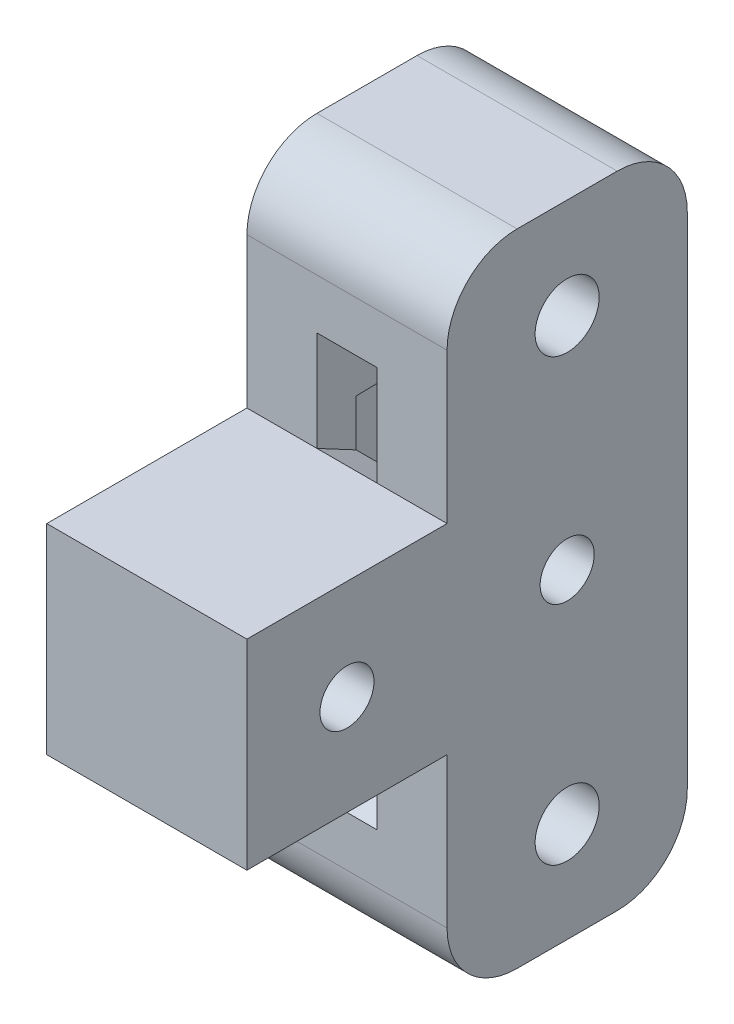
ISO-10303-21;
HEADER;
FILE_DESCRIPTION(('STEP AP214'),'2;1');
FILE_NAME('part.step','',(''),(''),'','','');
FILE_SCHEMA(('AUTOMOTIVE_DESIGN { 1 0 10303 214 1 1 1 1 }'));
ENDSEC;
DATA;
#1=APPLICATION_CONTEXT('core data for automotive mechanical design processes');
#2=APPLICATION_PROTOCOL_DEFINITION('international standard','automotive_design',2000,#1);
#3=PRODUCT_CONTEXT('',#1,'mechanical');
#4=PRODUCT('Part','Part','',(#3));
#5=PRODUCT_RELATED_PRODUCT_CATEGORY('part','',(#4));
#6=PRODUCT_DEFINITION_FORMATION('','',#4);
#7=PRODUCT_DEFINITION_CONTEXT('part definition',#1,'design');
#8=PRODUCT_DEFINITION('design','',#6,#7);
#9=PRODUCT_DEFINITION_SHAPE('','',#8);
#10=(LENGTH_UNIT() NAMED_UNIT(*) SI_UNIT(.MILLI.,.METRE.));
#11=(NAMED_UNIT(*) PLANE_ANGLE_UNIT() SI_UNIT($,.RADIAN.));
#12=(NAMED_UNIT(*) SI_UNIT($,.STERADIAN.) SOLID_ANGLE_UNIT());
#13=UNCERTAINTY_MEASURE_WITH_UNIT(LENGTH_MEASURE(1.E-05),#10,'distance_accuracy_value','');
#14=(GEOMETRIC_REPRESENTATION_CONTEXT(3) GLOBAL_UNCERTAINTY_ASSIGNED_CONTEXT((#13)) GLOBAL_UNIT_ASSIGNED_CONTEXT((#10,
#11,#12)) REPRESENTATION_CONTEXT('',''));
#15=CARTESIAN_POINT('',(0.,0.,0.));
#16=DIRECTION('',(0.,0.,1.));
#17=DIRECTION('',(1.,0.,0.));
#18=AXIS2_PLACEMENT_3D('',#15,#16,#17);
#19=CARTESIAN_POINT('',(10.,7.25364431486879,-12.));
#20=DIRECTION('',(-1.,0.,0.));
#21=DIRECTION('',(0.,0.,1.));
#22=AXIS2_PLACEMENT_3D('',#19,#20,#21);
#23=CYLINDRICAL_SURFACE('',#22,2.7);
#24=CARTESIAN_POINT('',(5.,7.25364431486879,-12.));
#25=DIRECTION('',(1.,0.,0.));
#26=DIRECTION('',(0.,1.,0.));
#27=AXIS2_PLACEMENT_3D('',#24,#25,#26);
#28=CIRCLE('',#27,2.7);
#29=CARTESIAN_POINT('',(5.,9.95364431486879,-12.));
#30=VERTEX_POINT('',#29);
#31=EDGE_CURVE('E331',#30,#30,#28,.T.);
#32=ORIENTED_EDGE('',*,*,#31,.F.);
#33=EDGE_LOOP('',(#32));
#34=FACE_BOUND('',#33,.T.);
#35=CARTESIAN_POINT('',(10.,7.25364431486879,-12.));
#36=DIRECTION('',(1.,0.,0.));
#37=DIRECTION('',(0.,0.,-1.));
#38=AXIS2_PLACEMENT_3D('',#35,#36,#37);
#39=CIRCLE('',#38,2.7);
#40=CARTESIAN_POINT('',(10.,7.25364431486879,-14.7));
#41=VERTEX_POINT('',#40);
#42=EDGE_CURVE('E417',#41,#41,#39,.T.);
#43=ORIENTED_EDGE('',*,*,#42,.T.);
#44=EDGE_LOOP('',(#43));
#45=FACE_BOUND('',#44,.T.);
#46=ADVANCED_FACE('F61',(#34,#45),#23,.F.);
#47=CARTESIAN_POINT('',(0.,-1.82878713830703,-1.29539088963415));
#48=DIRECTION('',(0.,-0.816024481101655,-0.578017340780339));
#49=DIRECTION('',(0.,0.578017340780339,-0.816024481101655));
#50=AXIS2_PLACEMENT_3D('',#47,#48,#49);
#51=PLANE('',#50);
#52=DIRECTION('',(-0.0169980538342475,0.577933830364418,-0.815906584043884));
#53=VECTOR('',#52,1.);
#54=CARTESIAN_POINT('',(-3.,-2.74635568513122,0.));
#55=LINE('',#54,#53);
#56=CARTESIAN_POINT('',(-3.,-2.74635568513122,0.));
#57=VERTEX_POINT('',#56);
#58=CARTESIAN_POINT('',(-3.08333333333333,0.0869776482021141,-4.));
#59=VERTEX_POINT('',#58);
#60=EDGE_CURVE('E463',#57,#59,#55,.T.);
#61=ORIENTED_EDGE('',*,*,#60,.T.);
#62=DIRECTION('',(1.,0.,0.));
#63=VECTOR('',#62,1.);
#64=CARTESIAN_POINT('',(0.,0.0869776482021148,-4.));
#65=LINE('',#64,#63);
#66=CARTESIAN_POINT('',(3.08333333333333,0.0869776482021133,-4.));
#67=VERTEX_POINT('',#66);
#68=EDGE_CURVE('E312',#59,#67,#65,.T.);
#69=ORIENTED_EDGE('',*,*,#68,.T.);
#70=DIRECTION('',(0.0169980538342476,0.577933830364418,-0.815906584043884));
#71=VECTOR('',#70,1.);
#72=CARTESIAN_POINT('',(3.,-2.74635568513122,0.));
#73=LINE('',#72,#71);
#74=CARTESIAN_POINT('',(3.,-2.74635568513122,0.));
#75=VERTEX_POINT('',#74);
#76=EDGE_CURVE('E653',#75,#67,#73,.T.);
#77=ORIENTED_EDGE('',*,*,#76,.F.);
#78=DIRECTION('',(-1.,0.,0.));
#79=VECTOR('',#78,1.);
#80=CARTESIAN_POINT('',(-3.,-2.74635568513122,0.));
#81=LINE('',#80,#79);
#82=EDGE_CURVE('E477',#75,#57,#81,.T.);
#83=ORIENTED_EDGE('',*,*,#82,.T.);
#84=EDGE_LOOP('',(#61,#69,#77,#83));
#85=FACE_BOUND('',#84,.T.);
#86=ADVANCED_FACE('F539',(#85),#51,.T.);
#87=CARTESIAN_POINT('',(-2.99869848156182,0.,0.062472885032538));
#88=DIRECTION('',(0.999783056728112,0.,-0.0208288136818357));
#89=DIRECTION('',(-0.0208288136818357,0.,-0.999783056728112));
#90=AXIS2_PLACEMENT_3D('',#87,#88,#89);
#91=PLANE('',#90);
#92=DIRECTION('',(-0.0208288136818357,0.,-0.999783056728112));
#93=VECTOR('',#92,1.);
#94=CARTESIAN_POINT('',(-2.99869848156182,-5.24635568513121,0.0624728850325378));
#95=LINE('',#94,#93);
#96=CARTESIAN_POINT('',(-3.08333333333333,-5.24635568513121,-4.));
#97=VERTEX_POINT('',#96);
#98=CARTESIAN_POINT('',(-3.22058823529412,-5.24635568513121,-10.5882352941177));
#99=VERTEX_POINT('',#98);
#100=EDGE_CURVE('E318',#97,#99,#95,.T.);
#101=ORIENTED_EDGE('',*,*,#100,.F.);
#102=DIRECTION('',(0.,1.,0.));
#103=VECTOR('',#102,1.);
#104=CARTESIAN_POINT('',(-3.08333333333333,0.,-4.));
#105=LINE('',#104,#103);
#106=EDGE_CURVE('E315',#97,#59,#105,.T.);
#107=ORIENTED_EDGE('',*,*,#106,.T.);
#108=ORIENTED_EDGE('',*,*,#60,.F.);
#109=DIRECTION('',(0.,-1.,0.));
#110=VECTOR('',#109,1.);
#111=CARTESIAN_POINT('',(-3.,-12.7463556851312,0.));
#112=LINE('',#111,#110);
#113=CARTESIAN_POINT('',(-3.,-12.7463556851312,0.));
#114=VERTEX_POINT('',#113);
#115=EDGE_CURVE('E467',#57,#114,#112,.T.);
#116=ORIENTED_EDGE('',*,*,#115,.T.);
#117=DIRECTION('',(-0.0169980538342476,0.577933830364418,-0.815906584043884));
#118=VECTOR('',#117,1.);
#119=CARTESIAN_POINT('',(-3.,-12.7463556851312,0.));
#120=LINE('',#119,#118);
#121=EDGE_CURVE('E494',#114,#99,#120,.T.);
#122=ORIENTED_EDGE('',*,*,#121,.T.);
#123=EDGE_LOOP('',(#101,#107,#108,#116,#122));
#124=FACE_BOUND('',#123,.T.);
#125=ADVANCED_FACE('F491',(#124),#91,.T.);
#126=CARTESIAN_POINT('',(2.99869848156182,0.,0.0624728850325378));
#127=DIRECTION('',(-0.999783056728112,0.,-0.0208288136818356));
#128=DIRECTION('',(-0.0208288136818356,0.,0.999783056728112));
#129=AXIS2_PLACEMENT_3D('',#126,#127,#128);
#130=PLANE('',#129);
#131=DIRECTION('',(0.0208288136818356,0.,-0.999783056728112));
#132=VECTOR('',#131,1.);
#133=CARTESIAN_POINT('',(2.99869848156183,19.7536443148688,0.0624728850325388));
#134=LINE('',#133,#132);
#135=CARTESIAN_POINT('',(3.08333333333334,19.7536443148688,-4.));
#136=VERTEX_POINT('',#135);
#137=CARTESIAN_POINT('',(3.28846153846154,19.7536443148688,-13.8461538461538));
#138=VERTEX_POINT('',#137);
#139=EDGE_CURVE('E292',#136,#138,#134,.T.);
#140=ORIENTED_EDGE('',*,*,#139,.F.);
#141=DIRECTION('',(0.,-1.,0.));
#142=VECTOR('',#141,1.);
#143=CARTESIAN_POINT('',(3.08333333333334,0.,-4.));
#144=LINE('',#143,#142);
#145=CARTESIAN_POINT('',(3.08333333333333,15.0869776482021,-3.99999999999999));
#146=VERTEX_POINT('',#145);
#147=EDGE_CURVE('E303',#136,#146,#144,.T.);
#148=ORIENTED_EDGE('',*,*,#147,.T.);
#149=DIRECTION('',(-0.0183155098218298,0.476203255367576,0.879144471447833));
#150=VECTOR('',#149,1.);
#151=CARTESIAN_POINT('',(3.5,4.25364431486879,-24.));
#152=LINE('',#151,#150);
#153=CARTESIAN_POINT('',(3.,17.2536443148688,0.));
#154=VERTEX_POINT('',#153);
#155=EDGE_CURVE('E327',#146,#154,#152,.T.);
#156=ORIENTED_EDGE('',*,*,#155,.T.);
#157=DIRECTION('',(0.,1.,0.));
#158=VECTOR('',#157,1.);
#159=CARTESIAN_POINT('',(3.,27.2536443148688,0.));
#160=LINE('',#159,#158);
#161=CARTESIAN_POINT('',(3.,27.2536443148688,0.));
#162=VERTEX_POINT('',#161);
#163=EDGE_CURVE('E744',#154,#162,#160,.T.);
#164=ORIENTED_EDGE('',*,*,#163,.T.);
#165=DIRECTION('',(-0.0183155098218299,0.476203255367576,0.879144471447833));
#166=VECTOR('',#165,1.);
#167=CARTESIAN_POINT('',(3.5,14.2536443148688,-24.));
#168=LINE('',#167,#166);
#169=EDGE_CURVE('E749',#138,#162,#168,.T.);
#170=ORIENTED_EDGE('',*,*,#169,.F.);
#171=EDGE_LOOP('',(#140,#148,#156,#164,#170));
#172=FACE_BOUND('',#171,.T.);
#173=ADVANCED_FACE('F677',(#172),#130,.T.);
#174=CARTESIAN_POINT('',(0.,13.3397303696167,-7.22568728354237));
#175=DIRECTION('',(0.,0.879291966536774,-0.476283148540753));
#176=DIRECTION('',(0.,0.476283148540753,0.879291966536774));
#177=AXIS2_PLACEMENT_3D('',#174,#175,#176);
#178=PLANE('',#177);
#179=ORIENTED_EDGE('',*,*,#155,.F.);
#180=DIRECTION('',(-1.,0.,0.));
#181=VECTOR('',#180,1.);
#182=CARTESIAN_POINT('',(0.,15.0869776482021,-4.));
#183=LINE('',#182,#181);
#184=CARTESIAN_POINT('',(-3.08333333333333,15.0869776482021,-3.99999999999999));
#185=VERTEX_POINT('',#184);
#186=EDGE_CURVE('E337',#146,#185,#183,.T.);
#187=ORIENTED_EDGE('',*,*,#186,.T.);
#188=DIRECTION('',(0.0183155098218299,0.476203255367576,0.879144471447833));
#189=VECTOR('',#188,1.);
#190=CARTESIAN_POINT('',(-3.5,4.25364431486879,-24.));
#191=LINE('',#190,#189);
#192=CARTESIAN_POINT('',(-3.,17.2536443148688,0.));
#193=VERTEX_POINT('',#192);
#194=EDGE_CURVE('E334',#185,#193,#191,.T.);
#195=ORIENTED_EDGE('',*,*,#194,.T.);
#196=DIRECTION('',(1.,0.,0.));
#197=VECTOR('',#196,1.);
#198=CARTESIAN_POINT('',(-3.,17.2536443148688,0.));
#199=LINE('',#198,#197);
#200=EDGE_CURVE('E627',#193,#154,#199,.T.);
#201=ORIENTED_EDGE('',*,*,#200,.T.);
#202=EDGE_LOOP('',(#179,#187,#195,#201));
#203=FACE_BOUND('',#202,.T.);
#204=ADVANCED_FACE('F772',(#203),#178,.T.);
#205=CARTESIAN_POINT('',(10.,39.2536443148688,0.));
#206=DIRECTION('',(0.,0.,-1.));
#207=DIRECTION('',(0.,1.,0.));
#208=AXIS2_PLACEMENT_3D('',#205,#206,#207);
#209=PLANE('',#208);
#210=DIRECTION('',(0.,-1.,0.));
#211=VECTOR('',#210,1.);
#212=CARTESIAN_POINT('',(10.,39.2536443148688,0.));
#213=LINE('',#212,#211);
#214=CARTESIAN_POINT('',(10.,32.2536443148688,0.));
#215=VERTEX_POINT('',#214);
#216=CARTESIAN_POINT('',(10.,17.2536443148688,0.));
#217=VERTEX_POINT('',#216);
#218=EDGE_CURVE('E595',#215,#217,#213,.T.);
#219=ORIENTED_EDGE('',*,*,#218,.F.);
#220=DIRECTION('',(-1.,0.,0.));
#221=VECTOR('',#220,1.);
#222=CARTESIAN_POINT('',(10.,32.2536443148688,0.));
#223=LINE('',#222,#221);
#224=CARTESIAN_POINT('',(-10.,32.2536443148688,0.));
#225=VERTEX_POINT('',#224);
#226=EDGE_CURVE('E386',#215,#225,#223,.T.);
#227=ORIENTED_EDGE('',*,*,#226,.T.);
#228=DIRECTION('',(0.,-1.,0.));
#229=VECTOR('',#228,1.);
#230=CARTESIAN_POINT('',(-10.,39.2536443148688,0.));
#231=LINE('',#230,#229);
#232=CARTESIAN_POINT('',(-10.,17.2536443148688,0.));
#233=VERTEX_POINT('',#232);
#234=EDGE_CURVE('E421',#225,#233,#231,.T.);
#235=ORIENTED_EDGE('',*,*,#234,.T.);
#236=DIRECTION('',(-1.,0.,0.));
#237=VECTOR('',#236,1.);
#238=CARTESIAN_POINT('',(10.,17.2536443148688,0.));
#239=LINE('',#238,#237);
#240=EDGE_CURVE('E453',#193,#233,#239,.T.);
#241=ORIENTED_EDGE('',*,*,#240,.F.);
#242=DIRECTION('',(0.,-1.,0.));
#243=VECTOR('',#242,1.);
#244=CARTESIAN_POINT('',(-3.,27.2536443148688,0.));
#245=LINE('',#244,#243);
#246=CARTESIAN_POINT('',(-3.,27.2536443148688,0.));
#247=VERTEX_POINT('',#246);
#248=EDGE_CURVE('E634',#247,#193,#245,.T.);
#249=ORIENTED_EDGE('',*,*,#248,.F.);
#250=DIRECTION('',(-1.,0.,0.));
#251=VECTOR('',#250,1.);
#252=CARTESIAN_POINT('',(-3.,27.2536443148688,0.));
#253=LINE('',#252,#251);
#254=EDGE_CURVE('E758',#162,#247,#253,.T.);
#255=ORIENTED_EDGE('',*,*,#254,.F.);
#256=ORIENTED_EDGE('',*,*,#163,.F.);
#257=EDGE_CURVE('E460',#217,#154,#239,.T.);
#258=ORIENTED_EDGE('',*,*,#257,.F.);
#259=EDGE_LOOP('',(#219,#227,#235,#241,#249,#255,#256,#258));
#260=FACE_BOUND('',#259,.T.);
#261=ADVANCED_FACE('F525',(#260),#209,.F.);
#262=CARTESIAN_POINT('',(10.,-2.74635568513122,0.));
#263=DIRECTION('',(0.,0.,-1.));
#264=DIRECTION('',(0.,1.,0.));
#265=AXIS2_PLACEMENT_3D('',#262,#263,#264);
#266=PLANE('',#265);
#267=DIRECTION('',(0.,-1.,0.));
#268=VECTOR('',#267,1.);
#269=CARTESIAN_POINT('',(-10.,-2.74635568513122,0.));
#270=LINE('',#269,#268);
#271=CARTESIAN_POINT('',(-10.,-2.74635568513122,0.));
#272=VERTEX_POINT('',#271);
#273=CARTESIAN_POINT('',(-10.,-17.7463556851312,0.));
#274=VERTEX_POINT('',#273);
#275=EDGE_CURVE('E408',#272,#274,#270,.T.);
#276=ORIENTED_EDGE('',*,*,#275,.T.);
#277=DIRECTION('',(-1.,0.,0.));
#278=VECTOR('',#277,1.);
#279=CARTESIAN_POINT('',(10.,-17.7463556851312,0.));
#280=LINE('',#279,#278);
#281=CARTESIAN_POINT('',(10.,-17.7463556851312,0.));
#282=VERTEX_POINT('',#281);
#283=EDGE_CURVE('E12',#274,#282,#280,.F.);
#284=ORIENTED_EDGE('',*,*,#283,.T.);
#285=DIRECTION('',(0.,-1.,0.));
#286=VECTOR('',#285,1.);
#287=CARTESIAN_POINT('',(10.,-2.74635568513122,0.));
#288=LINE('',#287,#286);
#289=CARTESIAN_POINT('',(10.,-2.74635568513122,0.));
#290=VERTEX_POINT('',#289);
#291=EDGE_CURVE('E436',#290,#282,#288,.T.);
#292=ORIENTED_EDGE('',*,*,#291,.F.);
#293=DIRECTION('',(-1.,0.,0.));
#294=VECTOR('',#293,1.);
#295=CARTESIAN_POINT('',(10.,-2.74635568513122,0.));
#296=LINE('',#295,#294);
#297=EDGE_CURVE('E447',#290,#75,#296,.T.);
#298=ORIENTED_EDGE('',*,*,#297,.T.);
#299=DIRECTION('',(0.,1.,0.));
#300=VECTOR('',#299,1.);
#301=CARTESIAN_POINT('',(3.,-12.7463556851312,0.));
#302=LINE('',#301,#300);
#303=CARTESIAN_POINT('',(3.,-12.7463556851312,0.));
#304=VERTEX_POINT('',#303);
#305=EDGE_CURVE('E484',#304,#75,#302,.T.);
#306=ORIENTED_EDGE('',*,*,#305,.F.);
#307=DIRECTION('',(1.,0.,0.));
#308=VECTOR('',#307,1.);
#309=CARTESIAN_POINT('',(-3.,-12.7463556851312,0.));
#310=LINE('',#309,#308);
#311=EDGE_CURVE('E462',#114,#304,#310,.T.);
#312=ORIENTED_EDGE('',*,*,#311,.F.);
#313=ORIENTED_EDGE('',*,*,#115,.F.);
#314=EDGE_CURVE('E442',#57,#272,#296,.T.);
#315=ORIENTED_EDGE('',*,*,#314,.T.);
#316=EDGE_LOOP('',(#276,#284,#292,#298,#306,#312,#313,#315));
#317=FACE_BOUND('',#316,.T.);
#318=ADVANCED_FACE('F499',(#317),#266,.F.);
#319=CARTESIAN_POINT('',(10.,-24.7463556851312,-24.));
#320=DIRECTION('',(0.,0.,1.));
#321=DIRECTION('',(0.,-1.,0.));
#322=AXIS2_PLACEMENT_3D('',#319,#320,#321);
#323=PLANE('',#322);
#324=DIRECTION('',(-1.,0.,0.));
#325=VECTOR('',#324,1.);
#326=CARTESIAN_POINT('',(-5.,-5.24635568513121,-24.));
#327=LINE('',#326,#325);
#328=CARTESIAN_POINT('',(5.,-5.24635568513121,-24.));
#329=VERTEX_POINT('',#328);
#330=CARTESIAN_POINT('',(-5.,-5.24635568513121,-24.));
#331=VERTEX_POINT('',#330);
#332=EDGE_CURVE('E283',#329,#331,#327,.T.);
#333=ORIENTED_EDGE('',*,*,#332,.F.);
#334=DIRECTION('',(0.,-1.,0.));
#335=VECTOR('',#334,1.);
#336=CARTESIAN_POINT('',(5.,-5.24635568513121,-24.));
#337=LINE('',#336,#335);
#338=CARTESIAN_POINT('',(5.,19.7536443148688,-24.));
#339=VERTEX_POINT('',#338);
#340=EDGE_CURVE('E243',#339,#329,#337,.T.);
#341=ORIENTED_EDGE('',*,*,#340,.F.);
#342=DIRECTION('',(1.,0.,0.));
#343=VECTOR('',#342,1.);
#344=CARTESIAN_POINT('',(-5.,19.7536443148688,-24.));
#345=LINE('',#344,#343);
#346=CARTESIAN_POINT('',(-5.,19.7536443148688,-24.));
#347=VERTEX_POINT('',#346);
#348=EDGE_CURVE('E270',#347,#339,#345,.T.);
#349=ORIENTED_EDGE('',*,*,#348,.F.);
#350=DIRECTION('',(0.,1.,0.));
#351=VECTOR('',#350,1.);
#352=CARTESIAN_POINT('',(-5.,-5.24635568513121,-24.));
#353=LINE('',#352,#351);
#354=EDGE_CURVE('E275',#331,#347,#353,.T.);
#355=ORIENTED_EDGE('',*,*,#354,.F.);
#356=EDGE_LOOP('',(#333,#341,#349,#355));
#357=FACE_BOUND('',#356,.T.);
#358=DIRECTION('',(0.,1.,0.));
#359=VECTOR('',#358,1.);
#360=CARTESIAN_POINT('',(-10.,-24.7463556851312,-24.));
#361=LINE('',#360,#359);
#362=CARTESIAN_POINT('',(-10.,-17.7463556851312,-24.));
#363=VERTEX_POINT('',#362);
#364=CARTESIAN_POINT('',(-10.,32.2536443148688,-24.));
#365=VERTEX_POINT('',#364);
#366=EDGE_CURVE('E409',#363,#365,#361,.T.);
#367=ORIENTED_EDGE('',*,*,#366,.T.);
#368=DIRECTION('',(-1.,0.,0.));
#369=VECTOR('',#368,1.);
#370=CARTESIAN_POINT('',(10.,32.2536443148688,-24.));
#371=LINE('',#370,#369);
#372=CARTESIAN_POINT('',(10.,32.2536443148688,-24.));
#373=VERTEX_POINT('',#372);
#374=EDGE_CURVE('E375',#365,#373,#371,.F.);
#375=ORIENTED_EDGE('',*,*,#374,.T.);
#376=DIRECTION('',(0.,1.,0.));
#377=VECTOR('',#376,1.);
#378=CARTESIAN_POINT('',(10.,-24.7463556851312,-24.));
#379=LINE('',#378,#377);
#380=CARTESIAN_POINT('',(10.,-17.7463556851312,-24.));
#381=VERTEX_POINT('',#380);
#382=EDGE_CURVE('E585',#381,#373,#379,.T.);
#383=ORIENTED_EDGE('',*,*,#382,.F.);
#384=DIRECTION('',(-1.,0.,0.));
#385=VECTOR('',#384,1.);
#386=CARTESIAN_POINT('',(10.,-17.7463556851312,-24.));
#387=LINE('',#386,#385);
#388=EDGE_CURVE('E368',#381,#363,#387,.T.);
#389=ORIENTED_EDGE('',*,*,#388,.T.);
#390=EDGE_LOOP('',(#367,#375,#383,#389));
#391=FACE_BOUND('',#390,.T.);
#392=ADVANCED_FACE('F521',(#357,#391),#323,.F.);
#393=CARTESIAN_POINT('',(-5.,7.25364431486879,-12.));
#394=DIRECTION('',(-1.,0.,0.));
#395=DIRECTION('',(0.,-1.,0.));
#396=AXIS2_PLACEMENT_3D('',#393,#394,#395);
#397=CIRCLE('',#396,2.7);
#398=CARTESIAN_POINT('',(-5.,4.55364431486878,-12.));
#399=VERTEX_POINT('',#398);
#400=EDGE_CURVE('E324',#399,#399,#397,.T.);
#401=ORIENTED_EDGE('',*,*,#400,.F.);
#402=EDGE_LOOP('',(#401));
#403=FACE_BOUND('',#402,.T.);
#404=CARTESIAN_POINT('',(-10.,7.25364431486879,-12.));
#405=DIRECTION('',(1.,0.,0.));
#406=DIRECTION('',(0.,0.,-1.));
#407=AXIS2_PLACEMENT_3D('',#404,#405,#406);
#408=CIRCLE('',#407,2.7);
#409=CARTESIAN_POINT('',(-10.,7.25364431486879,-14.7));
#410=VERTEX_POINT('',#409);
#411=EDGE_CURVE('E570',#410,#410,#408,.T.);
#412=ORIENTED_EDGE('',*,*,#411,.F.);
#413=EDGE_LOOP('',(#412));
#414=FACE_BOUND('',#413,.T.);
#415=ADVANCED_FACE('F541',(#403,#414),#23,.F.);
#416=CARTESIAN_POINT('',(10.,0.,0.));
#417=DIRECTION('',(1.,0.,0.));
#418=DIRECTION('',(0.,0.,-1.));
#419=AXIS2_PLACEMENT_3D('',#416,#417,#418);
#420=PLANE('',#419);
#421=CARTESIAN_POINT('',(10.,-14.7463556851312,-12.));
#422=DIRECTION('',(1.,0.,0.));
#423=DIRECTION('',(0.,0.,-1.));
#424=AXIS2_PLACEMENT_3D('',#421,#422,#423);
#425=CIRCLE('',#424,3.2);
#426=CARTESIAN_POINT('',(10.,-14.7463556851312,-15.2));
#427=VERTEX_POINT('',#426);
#428=EDGE_CURVE('E697',#427,#427,#425,.T.);
#429=ORIENTED_EDGE('',*,*,#428,.F.);
#430=EDGE_LOOP('',(#429));
#431=FACE_BOUND('',#430,.T.);
#432=ORIENTED_EDGE('',*,*,#42,.F.);
#433=EDGE_LOOP('',(#432));
#434=FACE_BOUND('',#433,.T.);
#435=ORIENTED_EDGE('',*,*,#382,.T.);
#436=CARTESIAN_POINT('',(10.,32.2536443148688,-17.));
#437=DIRECTION('',(1.,0.,0.));
#438=DIRECTION('',(0.,0.,-1.));
#439=AXIS2_PLACEMENT_3D('',#436,#437,#438);
#440=CIRCLE('',#439,7.);
#441=CARTESIAN_POINT('',(10.,39.2536443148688,-17.));
#442=VERTEX_POINT('',#441);
#443=EDGE_CURVE('E384',#373,#442,#440,.T.);
#444=ORIENTED_EDGE('',*,*,#443,.T.);
#445=DIRECTION('',(0.,0.,1.));
#446=VECTOR('',#445,1.);
#447=CARTESIAN_POINT('',(10.,39.2536443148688,-24.));
#448=LINE('',#447,#446);
#449=CARTESIAN_POINT('',(10.,39.2536443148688,-7.));
#450=VERTEX_POINT('',#449);
#451=EDGE_CURVE('E587',#442,#450,#448,.T.);
#452=ORIENTED_EDGE('',*,*,#451,.T.);
#453=CARTESIAN_POINT('',(10.,32.2536443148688,-7.));
#454=DIRECTION('',(1.,0.,0.));
#455=DIRECTION('',(0.,0.,-1.));
#456=AXIS2_PLACEMENT_3D('',#453,#454,#455);
#457=CIRCLE('',#456,7.);
#458=EDGE_CURVE('E80',#450,#215,#457,.T.);
#459=ORIENTED_EDGE('',*,*,#458,.T.);
#460=ORIENTED_EDGE('',*,*,#218,.T.);
#461=DIRECTION('',(0.,0.,1.));
#462=VECTOR('',#461,1.);
#463=CARTESIAN_POINT('',(10.,17.2536443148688,0.));
#464=LINE('',#463,#462);
#465=CARTESIAN_POINT('',(10.,17.2536443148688,20.));
#466=VERTEX_POINT('',#465);
#467=EDGE_CURVE('E593',#217,#466,#464,.T.);
#468=ORIENTED_EDGE('',*,*,#467,.T.);
#469=DIRECTION('',(0.,-1.,0.));
#470=VECTOR('',#469,1.);
#471=CARTESIAN_POINT('',(10.,17.2536443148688,20.));
#472=LINE('',#471,#470);
#473=CARTESIAN_POINT('',(10.,-2.74635568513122,20.));
#474=VERTEX_POINT('',#473);
#475=EDGE_CURVE('E596',#466,#474,#472,.T.);
#476=ORIENTED_EDGE('',*,*,#475,.T.);
#477=DIRECTION('',(0.,0.,-1.));
#478=VECTOR('',#477,1.);
#479=CARTESIAN_POINT('',(10.,-2.74635568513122,20.));
#480=LINE('',#479,#478);
#481=EDGE_CURVE('E598',#474,#290,#480,.T.);
#482=ORIENTED_EDGE('',*,*,#481,.T.);
#483=ORIENTED_EDGE('',*,*,#291,.T.);
#484=CARTESIAN_POINT('',(10.,-17.7463556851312,-7.));
#485=DIRECTION('',(1.,0.,0.));
#486=DIRECTION('',(0.,0.,-1.));
#487=AXIS2_PLACEMENT_3D('',#484,#485,#486);
#488=CIRCLE('',#487,7.);
#489=CARTESIAN_POINT('',(10.,-24.7463556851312,-7.));
#490=VERTEX_POINT('',#489);
#491=EDGE_CURVE('E377',#282,#490,#488,.T.);
#492=ORIENTED_EDGE('',*,*,#491,.T.);
#493=DIRECTION('',(0.,0.,-1.));
#494=VECTOR('',#493,1.);
#495=CARTESIAN_POINT('',(10.,-24.7463556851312,0.));
#496=LINE('',#495,#494);
#497=CARTESIAN_POINT('',(10.,-24.7463556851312,-17.));
#498=VERTEX_POINT('',#497);
#499=EDGE_CURVE('E400',#490,#498,#496,.T.);
#500=ORIENTED_EDGE('',*,*,#499,.T.);
#501=CARTESIAN_POINT('',(10.,-17.7463556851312,-17.));
#502=DIRECTION('',(1.,0.,0.));
#503=DIRECTION('',(0.,0.,-1.));
#504=AXIS2_PLACEMENT_3D('',#501,#502,#503);
#505=CIRCLE('',#504,7.);
#506=EDGE_CURVE('E374',#498,#381,#505,.T.);
#507=ORIENTED_EDGE('',*,*,#506,.T.);
#508=EDGE_LOOP('',(#435,#444,#452,#459,#460,#468,#476,#482,#483,#492,#500,#507));
#509=FACE_BOUND('',#508,.T.);
#510=CARTESIAN_POINT('',(10.,29.2536443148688,-12.));
#511=DIRECTION('',(1.,0.,0.));
#512=DIRECTION('',(0.,0.,-1.));
#513=AXIS2_PLACEMENT_3D('',#510,#511,#512);
#514=CIRCLE('',#513,3.20000000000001);
#515=CARTESIAN_POINT('',(10.,29.2536443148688,-15.2));
#516=VERTEX_POINT('',#515);
#517=EDGE_CURVE('E567',#516,#516,#514,.T.);
#518=ORIENTED_EDGE('',*,*,#517,.F.);
#519=EDGE_LOOP('',(#518));
#520=FACE_BOUND('',#519,.T.);
#521=CARTESIAN_POINT('',(10.,7.25364431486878,10.));
#522=DIRECTION('',(1.,0.,0.));
#523=DIRECTION('',(0.,0.,-1.));
#524=AXIS2_PLACEMENT_3D('',#521,#522,#523);
#525=CIRCLE('',#524,2.7);
#526=CARTESIAN_POINT('',(10.,7.25364431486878,7.3));
#527=VERTEX_POINT('',#526);
#528=EDGE_CURVE('E476',#527,#527,#525,.T.);
#529=ORIENTED_EDGE('',*,*,#528,.F.);
#530=EDGE_LOOP('',(#529));
#531=FACE_BOUND('',#530,.T.);
#532=ADVANCED_FACE('F551',(#431,#434,#509,#520,#531),#420,.T.);
#533=CARTESIAN_POINT('',(-10.,0.,0.));
#534=DIRECTION('',(1.,0.,0.));
#535=DIRECTION('',(0.,0.,-1.));
#536=AXIS2_PLACEMENT_3D('',#533,#534,#535);
#537=PLANE('',#536);
#538=DIRECTION('',(0.,0.,1.));
#539=VECTOR('',#538,1.);
#540=CARTESIAN_POINT('',(-10.,39.2536443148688,-24.));
#541=LINE('',#540,#539);
#542=CARTESIAN_POINT('',(-10.,39.2536443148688,-17.));
#543=VERTEX_POINT('',#542);
#544=CARTESIAN_POINT('',(-10.,39.2536443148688,-7.));
#545=VERTEX_POINT('',#544);
#546=EDGE_CURVE('E412',#543,#545,#541,.T.);
#547=ORIENTED_EDGE('',*,*,#546,.F.);
#548=CARTESIAN_POINT('',(-10.,32.2536443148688,-17.));
#549=DIRECTION('',(1.,0.,0.));
#550=DIRECTION('',(0.,0.,-1.));
#551=AXIS2_PLACEMENT_3D('',#548,#549,#550);
#552=CIRCLE('',#551,7.);
#553=EDGE_CURVE('E362',#543,#365,#552,.F.);
#554=ORIENTED_EDGE('',*,*,#553,.T.);
#555=ORIENTED_EDGE('',*,*,#366,.F.);
#556=CARTESIAN_POINT('',(-10.,-17.7463556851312,-17.));
#557=DIRECTION('',(1.,0.,0.));
#558=DIRECTION('',(0.,0.,-1.));
#559=AXIS2_PLACEMENT_3D('',#556,#557,#558);
#560=CIRCLE('',#559,7.);
#561=CARTESIAN_POINT('',(-10.,-24.7463556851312,-17.));
#562=VERTEX_POINT('',#561);
#563=EDGE_CURVE('E358',#363,#562,#560,.F.);
#564=ORIENTED_EDGE('',*,*,#563,.T.);
#565=DIRECTION('',(0.,0.,-1.));
#566=VECTOR('',#565,1.);
#567=CARTESIAN_POINT('',(-10.,-24.7463556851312,0.));
#568=LINE('',#567,#566);
#569=CARTESIAN_POINT('',(-10.,-24.7463556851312,-7.));
#570=VERTEX_POINT('',#569);
#571=EDGE_CURVE('E397',#570,#562,#568,.T.);
#572=ORIENTED_EDGE('',*,*,#571,.F.);
#573=CARTESIAN_POINT('',(-10.,-17.7463556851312,-7.));
#574=DIRECTION('',(1.,0.,0.));
#575=DIRECTION('',(0.,0.,-1.));
#576=AXIS2_PLACEMENT_3D('',#573,#574,#575);
#577=CIRCLE('',#576,7.);
#578=EDGE_CURVE('E360',#570,#274,#577,.F.);
#579=ORIENTED_EDGE('',*,*,#578,.T.);
#580=ORIENTED_EDGE('',*,*,#275,.F.);
#581=DIRECTION('',(0.,0.,-1.));
#582=VECTOR('',#581,1.);
#583=CARTESIAN_POINT('',(-10.,-2.74635568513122,20.));
#584=LINE('',#583,#582);
#585=CARTESIAN_POINT('',(-10.,-2.74635568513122,20.));
#586=VERTEX_POINT('',#585);
#587=EDGE_CURVE('E435',#586,#272,#584,.T.);
#588=ORIENTED_EDGE('',*,*,#587,.F.);
#589=DIRECTION('',(0.,-1.,0.));
#590=VECTOR('',#589,1.);
#591=CARTESIAN_POINT('',(-10.,17.2536443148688,20.));
#592=LINE('',#591,#590);
#593=CARTESIAN_POINT('',(-10.,17.2536443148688,20.));
#594=VERTEX_POINT('',#593);
#595=EDGE_CURVE('E429',#594,#586,#592,.T.);
#596=ORIENTED_EDGE('',*,*,#595,.F.);
#597=DIRECTION('',(0.,0.,1.));
#598=VECTOR('',#597,1.);
#599=CARTESIAN_POINT('',(-10.,17.2536443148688,0.));
#600=LINE('',#599,#598);
#601=EDGE_CURVE('E428',#233,#594,#600,.T.);
#602=ORIENTED_EDGE('',*,*,#601,.F.);
#603=ORIENTED_EDGE('',*,*,#234,.F.);
#604=CARTESIAN_POINT('',(-10.,32.2536443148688,-7.));
#605=DIRECTION('',(1.,0.,0.));
#606=DIRECTION('',(0.,0.,-1.));
#607=AXIS2_PLACEMENT_3D('',#604,#605,#606);
#608=CIRCLE('',#607,7.);
#609=EDGE_CURVE('E365',#225,#545,#608,.F.);
#610=ORIENTED_EDGE('',*,*,#609,.T.);
#611=EDGE_LOOP('',(#547,#554,#555,#564,#572,#579,#580,#588,#596,#602,#603,#610));
#612=FACE_BOUND('',#611,.T.);
#613=ORIENTED_EDGE('',*,*,#411,.T.);
#614=EDGE_LOOP('',(#613));
#615=FACE_BOUND('',#614,.T.);
#616=CARTESIAN_POINT('',(-10.,29.2536443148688,-12.));
#617=DIRECTION('',(1.,0.,0.));
#618=DIRECTION('',(0.,0.,-1.));
#619=AXIS2_PLACEMENT_3D('',#616,#617,#618);
#620=CIRCLE('',#619,3.20000000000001);
#621=CARTESIAN_POINT('',(-10.,29.2536443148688,-15.2));
#622=VERTEX_POINT('',#621);
#623=EDGE_CURVE('E577',#622,#622,#620,.T.);
#624=ORIENTED_EDGE('',*,*,#623,.T.);
#625=EDGE_LOOP('',(#624));
#626=FACE_BOUND('',#625,.T.);
#627=CARTESIAN_POINT('',(-10.,-14.7463556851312,-12.));
#628=DIRECTION('',(1.,0.,0.));
#629=DIRECTION('',(0.,0.,-1.));
#630=AXIS2_PLACEMENT_3D('',#627,#628,#629);
#631=CIRCLE('',#630,3.2);
#632=CARTESIAN_POINT('',(-10.,-14.7463556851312,-15.2));
#633=VERTEX_POINT('',#632);
#634=EDGE_CURVE('E705',#633,#633,#631,.T.);
#635=ORIENTED_EDGE('',*,*,#634,.T.);
#636=EDGE_LOOP('',(#635));
#637=FACE_BOUND('',#636,.T.);
#638=CARTESIAN_POINT('',(-10.,7.25364431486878,10.));
#639=DIRECTION('',(1.,0.,0.));
#640=DIRECTION('',(0.,0.,-1.));
#641=AXIS2_PLACEMENT_3D('',#638,#639,#640);
#642=CIRCLE('',#641,2.7);
#643=CARTESIAN_POINT('',(-10.,7.25364431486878,7.3));
#644=VERTEX_POINT('',#643);
#645=EDGE_CURVE('E710',#644,#644,#642,.T.);
#646=ORIENTED_EDGE('',*,*,#645,.T.);
#647=EDGE_LOOP('',(#646));
#648=FACE_BOUND('',#647,.T.);
#649=ADVANCED_FACE('F405',(#612,#615,#626,#637,#648),#537,.F.);
#650=CARTESIAN_POINT('',(10.,-24.7463556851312,0.));
#651=DIRECTION('',(0.,1.,0.));
#652=DIRECTION('',(0.,0.,1.));
#653=AXIS2_PLACEMENT_3D('',#650,#651,#652);
#654=PLANE('',#653);
#655=ORIENTED_EDGE('',*,*,#499,.F.);
#656=DIRECTION('',(-1.,0.,0.));
#657=VECTOR('',#656,1.);
#658=CARTESIAN_POINT('',(10.,-24.7463556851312,-7.));
#659=LINE('',#658,#657);
#660=EDGE_CURVE('E69',#490,#570,#659,.T.);
#661=ORIENTED_EDGE('',*,*,#660,.T.);
#662=ORIENTED_EDGE('',*,*,#571,.T.);
#663=DIRECTION('',(-1.,0.,0.));
#664=VECTOR('',#663,1.);
#665=CARTESIAN_POINT('',(10.,-24.7463556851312,-17.));
#666=LINE('',#665,#664);
#667=EDGE_CURVE('E85',#562,#498,#666,.F.);
#668=ORIENTED_EDGE('',*,*,#667,.T.);
#669=EDGE_LOOP('',(#655,#661,#662,#668));
#670=FACE_BOUND('',#669,.T.);
#671=ADVANCED_FACE('F394',(#670),#654,.F.);
#672=CARTESIAN_POINT('',(10.,39.2536443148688,-24.));
#673=DIRECTION('',(0.,-1.,0.));
#674=DIRECTION('',(0.,0.,-1.));
#675=AXIS2_PLACEMENT_3D('',#672,#673,#674);
#676=PLANE('',#675);
#677=ORIENTED_EDGE('',*,*,#451,.F.);
#678=DIRECTION('',(-1.,0.,0.));
#679=VECTOR('',#678,1.);
#680=CARTESIAN_POINT('',(10.,39.2536443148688,-17.));
#681=LINE('',#680,#679);
#682=EDGE_CURVE('E355',#442,#543,#681,.T.);
#683=ORIENTED_EDGE('',*,*,#682,.T.);
#684=ORIENTED_EDGE('',*,*,#546,.T.);
#685=DIRECTION('',(-1.,0.,0.));
#686=VECTOR('',#685,1.);
#687=CARTESIAN_POINT('',(10.,39.2536443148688,-7.));
#688=LINE('',#687,#686);
#689=EDGE_CURVE('E344',#545,#450,#688,.F.);
#690=ORIENTED_EDGE('',*,*,#689,.T.);
#691=EDGE_LOOP('',(#677,#683,#684,#690));
#692=FACE_BOUND('',#691,.T.);
#693=ADVANCED_FACE('F639',(#692),#676,.F.);
#694=CARTESIAN_POINT('',(10.,17.2536443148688,0.));
#695=DIRECTION('',(0.,-1.,0.));
#696=DIRECTION('',(0.,0.,-1.));
#697=AXIS2_PLACEMENT_3D('',#694,#695,#696);
#698=PLANE('',#697);
#699=ORIENTED_EDGE('',*,*,#601,.T.);
#700=DIRECTION('',(-1.,0.,0.));
#701=VECTOR('',#700,1.);
#702=CARTESIAN_POINT('',(10.,17.2536443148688,20.));
#703=LINE('',#702,#701);
#704=EDGE_CURVE('E451',#466,#594,#703,.T.);
#705=ORIENTED_EDGE('',*,*,#704,.F.);
#706=ORIENTED_EDGE('',*,*,#467,.F.);
#707=ORIENTED_EDGE('',*,*,#257,.T.);
#708=ORIENTED_EDGE('',*,*,#200,.F.);
#709=ORIENTED_EDGE('',*,*,#240,.T.);
#710=EDGE_LOOP('',(#699,#705,#706,#707,#708,#709));
#711=FACE_BOUND('',#710,.T.);
#712=ADVANCED_FACE('F630',(#711),#698,.F.);
#713=CARTESIAN_POINT('',(10.,17.2536443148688,20.));
#714=DIRECTION('',(0.,0.,-1.));
#715=DIRECTION('',(0.,1.,0.));
#716=AXIS2_PLACEMENT_3D('',#713,#714,#715);
#717=PLANE('',#716);
#718=ORIENTED_EDGE('',*,*,#595,.T.);
#719=DIRECTION('',(-1.,0.,0.));
#720=VECTOR('',#719,1.);
#721=CARTESIAN_POINT('',(10.,-2.74635568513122,20.));
#722=LINE('',#721,#720);
#723=EDGE_CURVE('E437',#474,#586,#722,.T.);
#724=ORIENTED_EDGE('',*,*,#723,.F.);
#725=ORIENTED_EDGE('',*,*,#475,.F.);
#726=ORIENTED_EDGE('',*,*,#704,.T.);
#727=EDGE_LOOP('',(#718,#724,#725,#726));
#728=FACE_BOUND('',#727,.T.);
#729=ADVANCED_FACE('F618',(#728),#717,.F.);
#730=CARTESIAN_POINT('',(10.,-2.74635568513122,20.));
#731=DIRECTION('',(0.,1.,0.));
#732=DIRECTION('',(0.,0.,1.));
#733=AXIS2_PLACEMENT_3D('',#730,#731,#732);
#734=PLANE('',#733);
#735=ORIENTED_EDGE('',*,*,#587,.T.);
#736=ORIENTED_EDGE('',*,*,#314,.F.);
#737=ORIENTED_EDGE('',*,*,#82,.F.);
#738=ORIENTED_EDGE('',*,*,#297,.F.);
#739=ORIENTED_EDGE('',*,*,#481,.F.);
#740=ORIENTED_EDGE('',*,*,#723,.T.);
#741=EDGE_LOOP('',(#735,#736,#737,#738,#739,#740));
#742=FACE_BOUND('',#741,.T.);
#743=ADVANCED_FACE('F607',(#742),#734,.F.);
#744=CARTESIAN_POINT('',(10.,29.2536443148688,-12.));
#745=DIRECTION('',(-1.,0.,0.));
#746=DIRECTION('',(0.,0.,1.));
#747=AXIS2_PLACEMENT_3D('',#744,#745,#746);
#748=CYLINDRICAL_SURFACE('',#747,3.20000000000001);
#749=ORIENTED_EDGE('',*,*,#517,.T.);
#750=EDGE_LOOP('',(#749));
#751=FACE_BOUND('',#750,.T.);
#752=ORIENTED_EDGE('',*,*,#623,.F.);
#753=EDGE_LOOP('',(#752));
#754=FACE_BOUND('',#753,.T.);
#755=ADVANCED_FACE('F685',(#751,#754),#748,.F.);
#756=CARTESIAN_POINT('',(10.,-14.7463556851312,-12.));
#757=DIRECTION('',(-1.,0.,0.));
#758=DIRECTION('',(0.,0.,1.));
#759=AXIS2_PLACEMENT_3D('',#756,#757,#758);
#760=CYLINDRICAL_SURFACE('',#759,3.2);
#761=ORIENTED_EDGE('',*,*,#428,.T.);
#762=EDGE_LOOP('',(#761));
#763=FACE_BOUND('',#762,.T.);
#764=ORIENTED_EDGE('',*,*,#634,.F.);
#765=EDGE_LOOP('',(#764));
#766=FACE_BOUND('',#765,.T.);
#767=ADVANCED_FACE('F683',(#763,#766),#760,.F.);
#768=CARTESIAN_POINT('',(10.,7.25364431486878,10.));
#769=DIRECTION('',(-1.,0.,0.));
#770=DIRECTION('',(0.,0.,1.));
#771=AXIS2_PLACEMENT_3D('',#768,#769,#770);
#772=CYLINDRICAL_SURFACE('',#771,2.7);
#773=ORIENTED_EDGE('',*,*,#528,.T.);
#774=EDGE_LOOP('',(#773));
#775=FACE_BOUND('',#774,.T.);
#776=ORIENTED_EDGE('',*,*,#645,.F.);
#777=EDGE_LOOP('',(#776));
#778=FACE_BOUND('',#777,.T.);
#779=ADVANCED_FACE('F680',(#775,#778),#772,.F.);
#780=DIRECTION('',(0.0208288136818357,0.,0.999783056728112));
#781=VECTOR('',#780,1.);
#782=CARTESIAN_POINT('',(-2.99869848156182,19.7536443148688,0.062472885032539));
#783=LINE('',#782,#781);
#784=CARTESIAN_POINT('',(-3.28846153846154,19.7536443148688,-13.8461538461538));
#785=VERTEX_POINT('',#784);
#786=CARTESIAN_POINT('',(-3.08333333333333,19.7536443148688,-4.));
#787=VERTEX_POINT('',#786);
#788=EDGE_CURVE('E297',#785,#787,#783,.T.);
#789=ORIENTED_EDGE('',*,*,#788,.F.);
#790=DIRECTION('',(0.0183155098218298,0.476203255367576,0.879144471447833));
#791=VECTOR('',#790,1.);
#792=CARTESIAN_POINT('',(-3.5,14.2536443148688,-24.));
#793=LINE('',#792,#791);
#794=EDGE_CURVE('E748',#785,#247,#793,.T.);
#795=ORIENTED_EDGE('',*,*,#794,.T.);
#796=ORIENTED_EDGE('',*,*,#248,.T.);
#797=ORIENTED_EDGE('',*,*,#194,.F.);
#798=EDGE_CURVE('E310',#185,#787,#105,.T.);
#799=ORIENTED_EDGE('',*,*,#798,.T.);
#800=EDGE_LOOP('',(#789,#795,#796,#797,#799));
#801=FACE_BOUND('',#800,.T.);
#802=ADVANCED_FACE('F678',(#801),#91,.T.);
#803=CARTESIAN_POINT('',(0.,-8.48774667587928,-6.01215389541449));
#804=DIRECTION('',(0.,0.816024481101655,0.578017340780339));
#805=DIRECTION('',(0.,-0.578017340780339,0.816024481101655));
#806=AXIS2_PLACEMENT_3D('',#803,#804,#805);
#807=PLANE('',#806);
#808=DIRECTION('',(1.,0.,0.));
#809=VECTOR('',#808,1.);
#810=CARTESIAN_POINT('',(0.,-5.24635568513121,-10.5882352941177));
#811=LINE('',#810,#809);
#812=CARTESIAN_POINT('',(3.22058823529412,-5.24635568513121,-10.5882352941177));
#813=VERTEX_POINT('',#812);
#814=EDGE_CURVE('E320',#99,#813,#811,.T.);
#815=ORIENTED_EDGE('',*,*,#814,.F.);
#816=ORIENTED_EDGE('',*,*,#121,.F.);
#817=ORIENTED_EDGE('',*,*,#311,.T.);
#818=DIRECTION('',(0.0169980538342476,0.577933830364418,-0.815906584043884));
#819=VECTOR('',#818,1.);
#820=CARTESIAN_POINT('',(3.,-12.7463556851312,0.));
#821=LINE('',#820,#819);
#822=EDGE_CURVE('E708',#304,#813,#821,.T.);
#823=ORIENTED_EDGE('',*,*,#822,.T.);
#824=EDGE_LOOP('',(#815,#816,#817,#823));
#825=FACE_BOUND('',#824,.T.);
#826=ADVANCED_FACE('F669',(#825),#807,.T.);
#827=DIRECTION('',(-0.0208288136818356,0.,0.999783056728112));
#828=VECTOR('',#827,1.);
#829=CARTESIAN_POINT('',(2.99869848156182,-5.24635568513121,0.0624728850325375));
#830=LINE('',#829,#828);
#831=CARTESIAN_POINT('',(3.08333333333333,-5.24635568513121,-4.));
#832=VERTEX_POINT('',#831);
#833=EDGE_CURVE('E253',#813,#832,#830,.T.);
#834=ORIENTED_EDGE('',*,*,#833,.F.);
#835=ORIENTED_EDGE('',*,*,#822,.F.);
#836=ORIENTED_EDGE('',*,*,#305,.T.);
#837=ORIENTED_EDGE('',*,*,#76,.T.);
#838=EDGE_CURVE('E308',#67,#832,#144,.T.);
#839=ORIENTED_EDGE('',*,*,#838,.T.);
#840=EDGE_LOOP('',(#834,#835,#836,#837,#839));
#841=FACE_BOUND('',#840,.T.);
#842=ADVANCED_FACE('F671',(#841),#130,.T.);
#843=CARTESIAN_POINT('',(0.,21.0712739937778,-11.4136067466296));
#844=DIRECTION('',(0.,-0.879291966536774,0.476283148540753));
#845=DIRECTION('',(0.,-0.476283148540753,-0.879291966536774));
#846=AXIS2_PLACEMENT_3D('',#843,#844,#845);
#847=PLANE('',#846);
#848=DIRECTION('',(-1.,0.,0.));
#849=VECTOR('',#848,1.);
#850=CARTESIAN_POINT('',(0.,19.7536443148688,-13.8461538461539));
#851=LINE('',#850,#849);
#852=EDGE_CURVE('E338',#138,#785,#851,.T.);
#853=ORIENTED_EDGE('',*,*,#852,.F.);
#854=ORIENTED_EDGE('',*,*,#169,.T.);
#855=ORIENTED_EDGE('',*,*,#254,.T.);
#856=ORIENTED_EDGE('',*,*,#794,.F.);
#857=EDGE_LOOP('',(#853,#854,#855,#856));
#858=FACE_BOUND('',#857,.T.);
#859=ADVANCED_FACE('F672',(#858),#847,.T.);
#860=CARTESIAN_POINT('',(5.,-5.24635568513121,-4.));
#861=DIRECTION('',(1.,0.,0.));
#862=DIRECTION('',(0.,1.,0.));
#863=AXIS2_PLACEMENT_3D('',#860,#861,#862);
#864=PLANE('',#863);
#865=ORIENTED_EDGE('',*,*,#31,.T.);
#866=EDGE_LOOP('',(#865));
#867=FACE_BOUND('',#866,.T.);
#868=ORIENTED_EDGE('',*,*,#340,.T.);
#869=DIRECTION('',(0.,0.,-1.));
#870=VECTOR('',#869,1.);
#871=CARTESIAN_POINT('',(5.,-5.24635568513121,-4.));
#872=LINE('',#871,#870);
#873=CARTESIAN_POINT('',(5.,-5.24635568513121,-4.));
#874=VERTEX_POINT('',#873);
#875=EDGE_CURVE('E240',#874,#329,#872,.T.);
#876=ORIENTED_EDGE('',*,*,#875,.F.);
#877=DIRECTION('',(0.,-1.,0.));
#878=VECTOR('',#877,1.);
#879=CARTESIAN_POINT('',(5.,-5.24635568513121,-4.));
#880=LINE('',#879,#878);
#881=CARTESIAN_POINT('',(5.,19.7536443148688,-4.));
#882=VERTEX_POINT('',#881);
#883=EDGE_CURVE('E241',#882,#874,#880,.T.);
#884=ORIENTED_EDGE('',*,*,#883,.F.);
#885=DIRECTION('',(0.,0.,-1.));
#886=VECTOR('',#885,1.);
#887=CARTESIAN_POINT('',(5.,19.7536443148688,-4.));
#888=LINE('',#887,#886);
#889=EDGE_CURVE('E286',#882,#339,#888,.T.);
#890=ORIENTED_EDGE('',*,*,#889,.T.);
#891=EDGE_LOOP('',(#868,#876,#884,#890));
#892=FACE_BOUND('',#891,.T.);
#893=ADVANCED_FACE('F237',(#867,#892),#864,.F.);
#894=CARTESIAN_POINT('',(-5.,19.7536443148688,-4.));
#895=DIRECTION('',(0.,1.,0.));
#896=DIRECTION('',(0.,0.,1.));
#897=AXIS2_PLACEMENT_3D('',#894,#895,#896);
#898=PLANE('',#897);
#899=ORIENTED_EDGE('',*,*,#788,.T.);
#900=DIRECTION('',(1.,0.,0.));
#901=VECTOR('',#900,1.);
#902=CARTESIAN_POINT('',(-5.,19.7536443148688,-4.));
#903=LINE('',#902,#901);
#904=CARTESIAN_POINT('',(-5.,19.7536443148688,-4.));
#905=VERTEX_POINT('',#904);
#906=EDGE_CURVE('E248',#905,#787,#903,.T.);
#907=ORIENTED_EDGE('',*,*,#906,.F.);
#908=DIRECTION('',(0.,0.,-1.));
#909=VECTOR('',#908,1.);
#910=CARTESIAN_POINT('',(-5.,19.7536443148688,-4.));
#911=LINE('',#910,#909);
#912=EDGE_CURVE('E291',#905,#347,#911,.T.);
#913=ORIENTED_EDGE('',*,*,#912,.T.);
#914=ORIENTED_EDGE('',*,*,#348,.T.);
#915=ORIENTED_EDGE('',*,*,#889,.F.);
#916=EDGE_CURVE('E262',#136,#882,#903,.T.);
#917=ORIENTED_EDGE('',*,*,#916,.F.);
#918=ORIENTED_EDGE('',*,*,#139,.T.);
#919=ORIENTED_EDGE('',*,*,#852,.T.);
#920=EDGE_LOOP('',(#899,#907,#913,#914,#915,#917,#918,#919));
#921=FACE_BOUND('',#920,.T.);
#922=ADVANCED_FACE('F791',(#921),#898,.F.);
#923=CARTESIAN_POINT('',(-5.,-5.24635568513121,-4.));
#924=DIRECTION('',(-1.,0.,0.));
#925=DIRECTION('',(0.,-1.,0.));
#926=AXIS2_PLACEMENT_3D('',#923,#924,#925);
#927=PLANE('',#926);
#928=ORIENTED_EDGE('',*,*,#400,.T.);
#929=EDGE_LOOP('',(#928));
#930=FACE_BOUND('',#929,.T.);
#931=ORIENTED_EDGE('',*,*,#354,.T.);
#932=ORIENTED_EDGE('',*,*,#912,.F.);
#933=DIRECTION('',(0.,1.,0.));
#934=VECTOR('',#933,1.);
#935=CARTESIAN_POINT('',(-5.,-5.24635568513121,-4.));
#936=LINE('',#935,#934);
#937=CARTESIAN_POINT('',(-5.,-5.24635568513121,-4.));
#938=VERTEX_POINT('',#937);
#939=EDGE_CURVE('E258',#938,#905,#936,.T.);
#940=ORIENTED_EDGE('',*,*,#939,.F.);
#941=DIRECTION('',(0.,0.,-1.));
#942=VECTOR('',#941,1.);
#943=CARTESIAN_POINT('',(-5.,-5.24635568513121,-4.));
#944=LINE('',#943,#942);
#945=EDGE_CURVE('E247',#938,#331,#944,.T.);
#946=ORIENTED_EDGE('',*,*,#945,.T.);
#947=EDGE_LOOP('',(#931,#932,#940,#946));
#948=FACE_BOUND('',#947,.T.);
#949=ADVANCED_FACE('F801',(#930,#948),#927,.F.);
#950=CARTESIAN_POINT('',(-5.,-5.24635568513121,-4.));
#951=DIRECTION('',(0.,-1.,0.));
#952=DIRECTION('',(0.,0.,-1.));
#953=AXIS2_PLACEMENT_3D('',#950,#951,#952);
#954=PLANE('',#953);
#955=ORIENTED_EDGE('',*,*,#100,.T.);
#956=ORIENTED_EDGE('',*,*,#814,.T.);
#957=ORIENTED_EDGE('',*,*,#833,.T.);
#958=DIRECTION('',(-1.,0.,0.));
#959=VECTOR('',#958,1.);
#960=CARTESIAN_POINT('',(-5.,-5.24635568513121,-4.));
#961=LINE('',#960,#959);
#962=EDGE_CURVE('E255',#874,#832,#961,.T.);
#963=ORIENTED_EDGE('',*,*,#962,.F.);
#964=ORIENTED_EDGE('',*,*,#875,.T.);
#965=ORIENTED_EDGE('',*,*,#332,.T.);
#966=ORIENTED_EDGE('',*,*,#945,.F.);
#967=EDGE_CURVE('E260',#97,#938,#961,.T.);
#968=ORIENTED_EDGE('',*,*,#967,.F.);
#969=EDGE_LOOP('',(#955,#956,#957,#963,#964,#965,#966,#968));
#970=FACE_BOUND('',#969,.T.);
#971=ADVANCED_FACE('F254',(#970),#954,.F.);
#972=CARTESIAN_POINT('',(0.,0.,-4.));
#973=DIRECTION('',(0.,0.,-1.));
#974=DIRECTION('',(-1.,0.,0.));
#975=AXIS2_PLACEMENT_3D('',#972,#973,#974);
#976=PLANE('',#975);
#977=ORIENTED_EDGE('',*,*,#967,.T.);
#978=ORIENTED_EDGE('',*,*,#939,.T.);
#979=ORIENTED_EDGE('',*,*,#906,.T.);
#980=ORIENTED_EDGE('',*,*,#798,.F.);
#981=ORIENTED_EDGE('',*,*,#186,.F.);
#982=ORIENTED_EDGE('',*,*,#147,.F.);
#983=ORIENTED_EDGE('',*,*,#916,.T.);
#984=ORIENTED_EDGE('',*,*,#883,.T.);
#985=ORIENTED_EDGE('',*,*,#962,.T.);
#986=ORIENTED_EDGE('',*,*,#838,.F.);
#987=ORIENTED_EDGE('',*,*,#68,.F.);
#988=ORIENTED_EDGE('',*,*,#106,.F.);
#989=EDGE_LOOP('',(#977,#978,#979,#980,#981,#982,#983,#984,#985,#986,#987,#988));
#990=FACE_BOUND('',#989,.T.);
#991=ADVANCED_FACE('F265',(#990),#976,.T.);
#992=CARTESIAN_POINT('',(10.,32.2536443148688,-17.));
#993=DIRECTION('',(-1.,0.,0.));
#994=DIRECTION('',(0.,0.,1.));
#995=AXIS2_PLACEMENT_3D('',#992,#993,#994);
#996=CYLINDRICAL_SURFACE('',#995,7.);
#997=ORIENTED_EDGE('',*,*,#443,.F.);
#998=ORIENTED_EDGE('',*,*,#374,.F.);
#999=ORIENTED_EDGE('',*,*,#553,.F.);
#1000=ORIENTED_EDGE('',*,*,#682,.F.);
#1001=EDGE_LOOP('',(#997,#998,#999,#1000));
#1002=FACE_BOUND('',#1001,.T.);
#1003=ADVANCED_FACE('F522',(#1002),#996,.T.);
#1004=CARTESIAN_POINT('',(10.,32.2536443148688,-7.));
#1005=DIRECTION('',(-1.,0.,0.));
#1006=DIRECTION('',(0.,0.,1.));
#1007=AXIS2_PLACEMENT_3D('',#1004,#1005,#1006);
#1008=CYLINDRICAL_SURFACE('',#1007,7.);
#1009=ORIENTED_EDGE('',*,*,#458,.F.);
#1010=ORIENTED_EDGE('',*,*,#689,.F.);
#1011=ORIENTED_EDGE('',*,*,#609,.F.);
#1012=ORIENTED_EDGE('',*,*,#226,.F.);
#1013=EDGE_LOOP('',(#1009,#1010,#1011,#1012));
#1014=FACE_BOUND('',#1013,.T.);
#1015=ADVANCED_FACE('F530',(#1014),#1008,.T.);
#1016=CARTESIAN_POINT('',(10.,-17.7463556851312,-7.));
#1017=DIRECTION('',(-1.,0.,0.));
#1018=DIRECTION('',(0.,0.,1.));
#1019=AXIS2_PLACEMENT_3D('',#1016,#1017,#1018);
#1020=CYLINDRICAL_SURFACE('',#1019,7.);
#1021=ORIENTED_EDGE('',*,*,#491,.F.);
#1022=ORIENTED_EDGE('',*,*,#283,.F.);
#1023=ORIENTED_EDGE('',*,*,#578,.F.);
#1024=ORIENTED_EDGE('',*,*,#660,.F.);
#1025=EDGE_LOOP('',(#1021,#1022,#1023,#1024));
#1026=FACE_BOUND('',#1025,.T.);
#1027=ADVANCED_FACE('F528',(#1026),#1020,.T.);
#1028=CARTESIAN_POINT('',(10.,-17.7463556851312,-17.));
#1029=DIRECTION('',(-1.,0.,0.));
#1030=DIRECTION('',(0.,0.,1.));
#1031=AXIS2_PLACEMENT_3D('',#1028,#1029,#1030);
#1032=CYLINDRICAL_SURFACE('',#1031,7.);
#1033=ORIENTED_EDGE('',*,*,#506,.F.);
#1034=ORIENTED_EDGE('',*,*,#667,.F.);
#1035=ORIENTED_EDGE('',*,*,#563,.F.);
#1036=ORIENTED_EDGE('',*,*,#388,.F.);
#1037=EDGE_LOOP('',(#1033,#1034,#1035,#1036));
#1038=FACE_BOUND('',#1037,.T.);
#1039=ADVANCED_FACE('F64',(#1038),#1032,.T.);
#1040=CLOSED_SHELL('',(#46,#86,#125,#173,#204,#261,#318,#392,#415,#532,#649,#671,#693,#712,#729,
#743,#755,#767,#779,#802,#826,#842,#859,#893,#922,#949,#971,#991,#1003,#1015,#1027,#1039));
#1041=MANIFOLD_SOLID_BREP('B2',#1040);
#1042=ADVANCED_BREP_SHAPE_REPRESENTATION('',(#18,#1041),#14);
#1043=SHAPE_DEFINITION_REPRESENTATION(#9,#1042);
ENDSEC;
END-ISO-10303-21;
